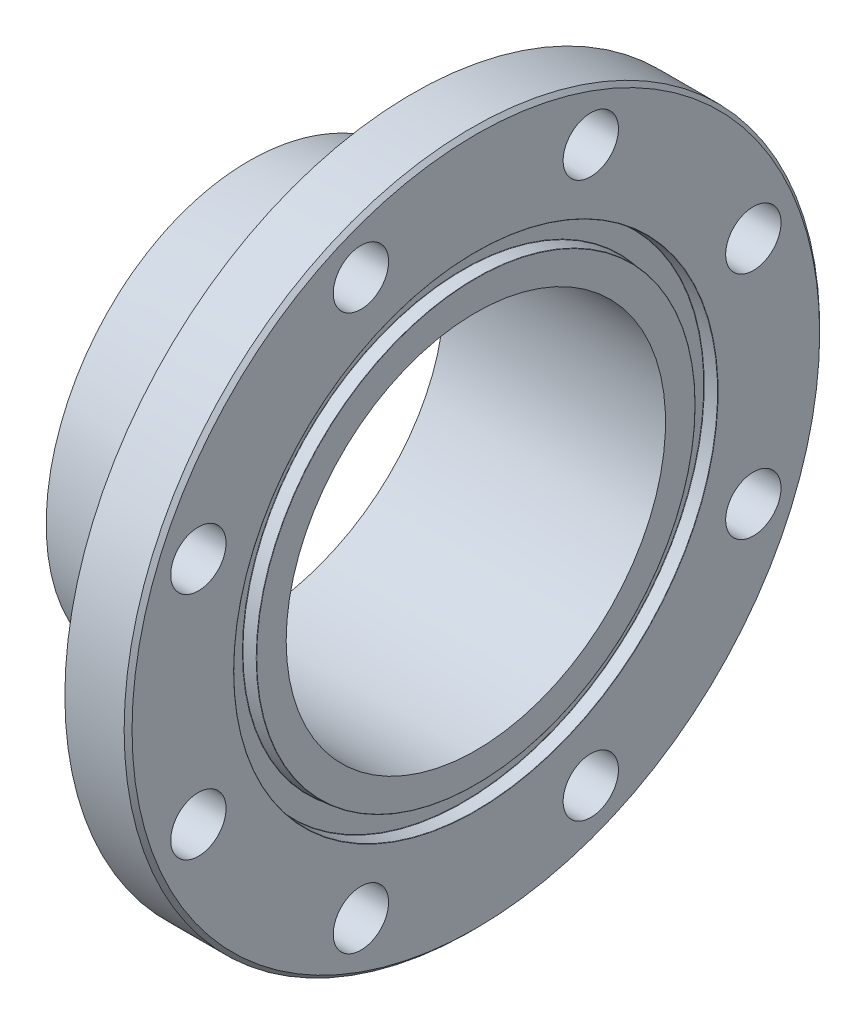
from build123d import *

# Parameters (mm, degrees)
SKETCH2_R          = 1524
CUT_EXTRUDE1_DEPTH = 139.7
CIRPATTERN1_COUNT  = 8
CHAMFER1_SIZE      = 1.5875
FILLET1_R          = 9.525


with BuildPart() as part:
    # Sketch1 → Revolve1 (revolve)
    with BuildSketch(Plane(origin=(0, 0, 0), x_dir=(1, 0, 0), z_dir=(0, 1, 0)), mode=Mode.PRIVATE) as revolve1_sk:
        with BuildLine():
            Line((0, 76.2), (107.95, 76.2))
            Line((107.95, 76.2), (107.95, 88.019461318))
            ThreePointArc((107.95, 88.019461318), (107.916634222, 88.105261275), (107.834068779, 88.145978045))
            Line((107.834068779, 88.145978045), (102.960531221, 88.572357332))
            ThreePointArc((102.960531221, 88.572357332), (102.877965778, 88.613074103), (102.8446, 88.698874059))
            Line((102.8446, 88.698874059), (102.8446, 96.644925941))
            ThreePointArc((102.8446, 96.644925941), (102.877965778, 96.730725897), (102.960531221, 96.771442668))
            Line((102.960531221, 96.771442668), (107.834068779, 97.197821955))
            ThreePointArc((107.834068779, 97.197821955), (107.916634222, 97.238538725), (107.95, 97.324338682))
            Line((107.95, 97.324338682), (107.95, 139.7))
            Line((107.95, 139.7), (82.55, 139.7))
            Line((82.55, 139.7), (82.55, 95.25))
            Line((82.55, 95.25), (12.7, 82.55))
            Line((12.7, 82.55), (0, 82.55))
            Line((0, 82.55), (0, 76.2))
        make_face()
    revolve(revolve1_sk.sketch.rotate(Axis((0, 0, 0), (1, 0, 0)), 180), axis=Axis((0, 0, 0), (1, 0, 0)))

    # Sketch2 → Cut-Extrude1 (cut, symmetric)
    with BuildSketch(Plane.XY):
        with Locations((-1504.95, 0)):
            Circle(SKETCH2_R)
    extrude(amount=CUT_EXTRUDE1_DEPTH, both=True, mode=Mode.SUBTRACT)

    # Sketch4 → 7_8 _0.875_ Diameter Hole1 (revolve, cut)
    with BuildSketch(Plane(origin=(107.95, 46.170756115, 111.466065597), x_dir=(0, 0, -1), z_dir=(0, 1, 0))):
        Polygon((0, 0), (0, 82.877063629), (11.1125, 76.2), (11.1125, 0), align=None)
    f_7_8_0_875_diameter_hole1 = revolve(axis=Axis((114.3, 46.170756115, 111.466065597), (-1, 0, 0)), mode=Mode.SUBTRACT)

    # CirPattern1: 7_8 _0.875_ Diameter Hole1 ×8 about axis
    cirpattern1_axis = Axis((0, 0, 0), (1, 0, 0))
    for i in range(1, CIRPATTERN1_COUNT):
        add(f_7_8_0_875_diameter_hole1.rotate(cirpattern1_axis, i * 360 / CIRPATTERN1_COUNT), mode=Mode.SUBTRACT)

    # Chamfer1
    chamfer1_edges = [part.edges().sort_by_distance(p)[0] for p in [
        (107.95, 0, -139.7),
    ]]
    chamfer(chamfer1_edges, length=CHAMFER1_SIZE)

    # Fillet1
    fillet1_edges = [part.edges().sort_by_distance(p)[0] for p in [
        (82.55, 0, -95.25),
    ]]
    fillet(fillet1_edges, radius=FILLET1_R)


solid = part.part
